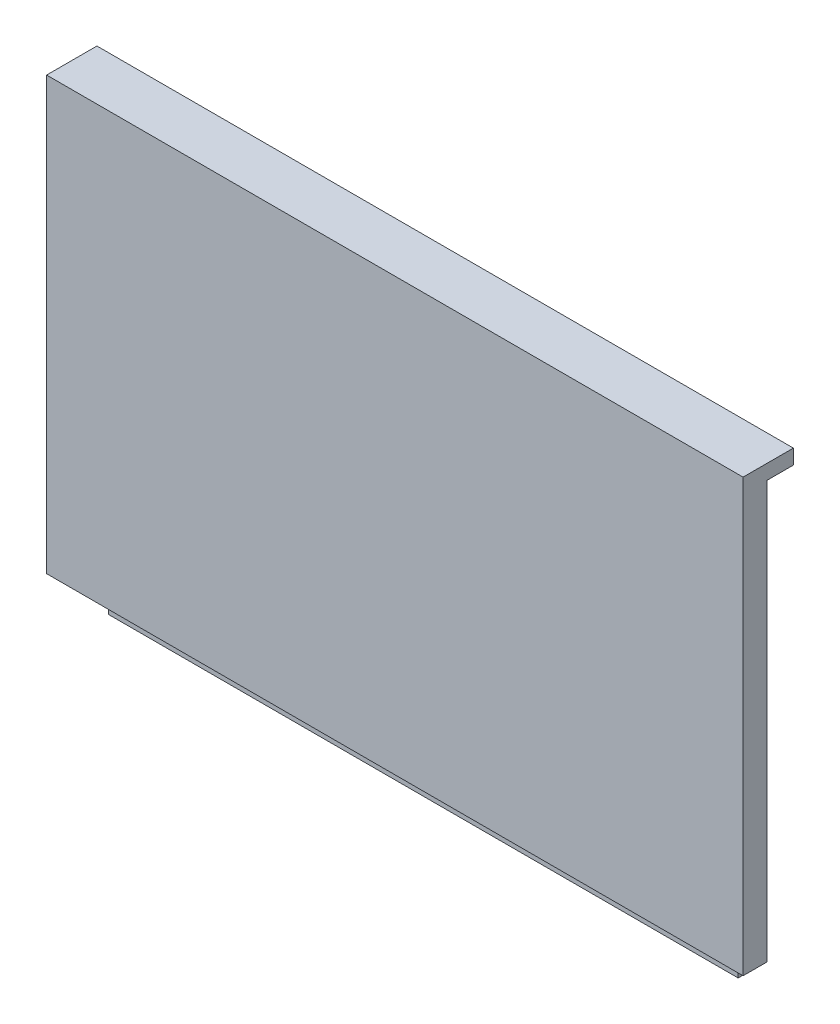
from build123d import *

# Parameters (mm, degrees)
SKETCH1_W           = 57.6
SKETCH1_H           = 2
BOSS_EXTRUDE1_DEPTH = 42.5
BOSS_EXTRUDE2_DEPTH = 39.5
SKETCH3_W           = 63.7
SKETCH3_H           = 4.6
BOSS_EXTRUDE3_DEPTH = 1.35
CUT_EXTRUDE1_DEPTH  = 1


with BuildPart() as part:
    # Sketch1 → Boss-Extrude1 (new body)
    with BuildSketch(Plane(origin=(0, 0, 0), x_dir=(1, 0, 0), z_dir=(0, 1, 0))):
        Rectangle(SKETCH1_W, SKETCH1_H)
    extrude(amount=BOSS_EXTRUDE1_DEPTH)

    # Sketch2 → Boss-Extrude2 (add)
    with BuildSketch(Plane(origin=(0, 42.5, 0), x_dir=(1, 0, 0), z_dir=(0, 1, 0))):
        Polygon((-28.8, -1), (28.8, -1), (28.8, -1.4), (31.85, -1.4), (31.85, -3.6), (28.931422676, -3.6), (-29.068577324, -3.6), (-31.85, -3.6), (-31.85, -1.4), (-28.8, -1.4), align=None)
    extrude(amount=-BOSS_EXTRUDE2_DEPTH)

    # Sketch3 → Boss-Extrude3 (add)
    with BuildSketch(Plane(origin=(0, 42.5, 0), x_dir=(1, 0, 0), z_dir=(0, 1, 0))):
        with Locations((0, -1.3)):
            Rectangle(SKETCH3_W, SKETCH3_H)
    extrude(amount=-BOSS_EXTRUDE3_DEPTH)

    # Sketch4 → Cut-Extrude1 (cut)
    with BuildSketch(Plane.XY.offset(-1)):
        Polygon((-12.5, 13.783121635), (12.5, 13.783121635), (0, 35.43375673), align=None)
    extrude(amount=CUT_EXTRUDE1_DEPTH, mode=Mode.SUBTRACT)


solid = part.part
